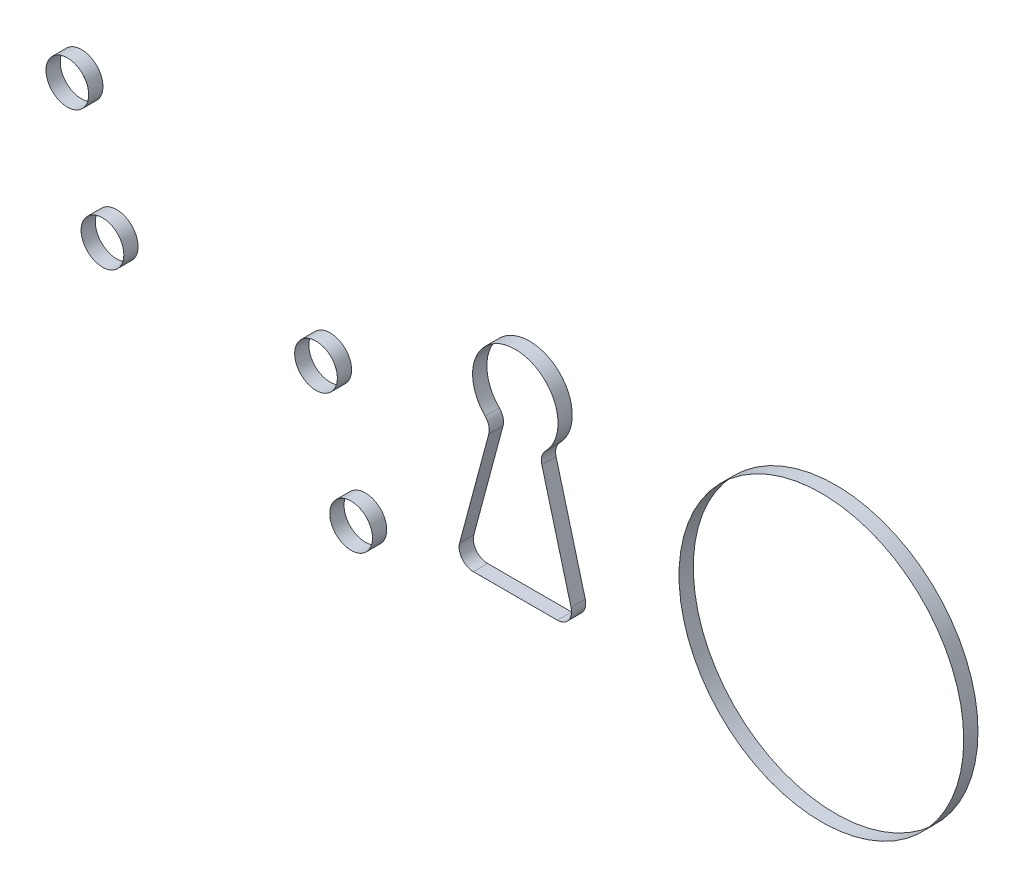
from build123d import *

# Parameters (mm, degrees)
ESQUISSE1_R          = 1.501
ESQUISSE1_R_2        = 1.5
EXTRU_MINCE1_DEPTH   = 1
EXTRU_MINCE1_2_DEPTH = 1
EXTRU_MINCE1_3_DEPTH = 1
EXTRU_MINCE1_4_DEPTH = 1
ESQUISSE1_R_3        = 10.001
ESQUISSE1_R_4        = 10
EXTRU_MINCE1_5_DEPTH = 1
EXTRU_MINCE1_6_DEPTH = 1


with BuildPart() as part:
    # Esquisse1 → Extru.-Mince1 (new body)
    with BuildSketch(Plane.XY):
        with Locations((7.5, 0)):
            Circle(ESQUISSE1_R)
        with Locations((7.5, 0)):
            Circle(ESQUISSE1_R_2, mode=Mode.SUBTRACT)
    extrude(amount=EXTRU_MINCE1_DEPTH)


with BuildPart() as body_2:
    # Esquisse1 → Extru.-Mince1 2 (new body)
    with BuildSketch(Plane.XY):
        with Locations((-7.5, 0)):
            Circle(ESQUISSE1_R)
        with Locations((-7.5, 0)):
            Circle(ESQUISSE1_R_2, mode=Mode.SUBTRACT)
    extrude(amount=EXTRU_MINCE1_2_DEPTH)


with BuildPart() as body_3:
    # Esquisse1 → Extru.-Mince1 3 (new body)
    with BuildSketch(Plane.XY):
        with Locations((9.967948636, -8.5)):
            Circle(ESQUISSE1_R)
        with Locations((9.967948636, -8.5)):
            Circle(ESQUISSE1_R_2, mode=Mode.SUBTRACT)
    extrude(amount=EXTRU_MINCE1_3_DEPTH)


with BuildPart() as body_4:
    # Esquisse1 → Extru.-Mince1 4 (new body)
    with BuildSketch(Plane.XY):
        with Locations((-9.967948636, 8.5)):
            Circle(ESQUISSE1_R)
        with Locations((-9.967948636, 8.5)):
            Circle(ESQUISSE1_R_2, mode=Mode.SUBTRACT)
    extrude(amount=EXTRU_MINCE1_4_DEPTH)


with BuildPart() as body_5:
    # Esquisse1 → Extru.-Mince1 5 (new body)
    with BuildSketch(Plane.XY):
        with Locations((43, 0)):
            Circle(ESQUISSE1_R_3)
        with Locations((43, 0)):
            Circle(ESQUISSE1_R_4, mode=Mode.SUBTRACT)
    extrude(amount=EXTRU_MINCE1_5_DEPTH)


with BuildPart() as body_6:
    # Esquisse1 → Extru.-Mince1 6 (new body)
    with BuildSketch(Plane.XY):
        with BuildLine():
            Line((25.414332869, -5.740922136), (23.363467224, 1.913012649))
            ThreePointArc((23.363467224, 1.913012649), (23.363467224, 2.430133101), (23.62202745, 2.87797255))
            ThreePointArc((23.62202745, 2.87797255), (21.5, 8.001), (19.37797255, 2.87797255))
            ThreePointArc((19.37797255, 2.87797255), (19.636532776, 2.430133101), (19.636532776, 1.913012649))
            Line((19.636532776, 1.913012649), (17.585667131, -5.740922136))
            ThreePointArc((17.585667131, -5.740922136), (17.75841219, -6.60937019), (18.552558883, -7.001))
            Line((18.552558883, -7.001), (24.447441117, -7.001))
            ThreePointArc((24.447441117, -7.001), (25.24158781, -6.60937019), (25.414332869, -5.740922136))
        make_face()
        with BuildLine():
            Line((25.413366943, -5.741180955), (23.362501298, 1.91275383))
            ThreePointArc((23.362501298, 1.91275383), (23.362501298, 2.43039192), (23.621320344, 2.878679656))
            ThreePointArc((23.621320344, 2.878679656), (21.5, 8), (19.378679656, 2.878679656))
            ThreePointArc((19.378679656, 2.878679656), (19.637498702, 2.43039192), (19.637498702, 1.91275383))
            Line((19.637498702, 1.91275383), (17.586633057, -5.741180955))
            ThreePointArc((17.586633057, -5.741180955), (17.759205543, -6.608761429), (18.552558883, -7))
            Line((18.552558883, -7), (24.447441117, -7))
            ThreePointArc((24.447441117, -7), (25.240794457, -6.608761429), (25.413366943, -5.741180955))
        make_face(mode=Mode.SUBTRACT)
    extrude(amount=EXTRU_MINCE1_6_DEPTH)


solid = Compound([part.part, body_2.part, body_3.part, body_4.part, body_5.part, body_6.part])
